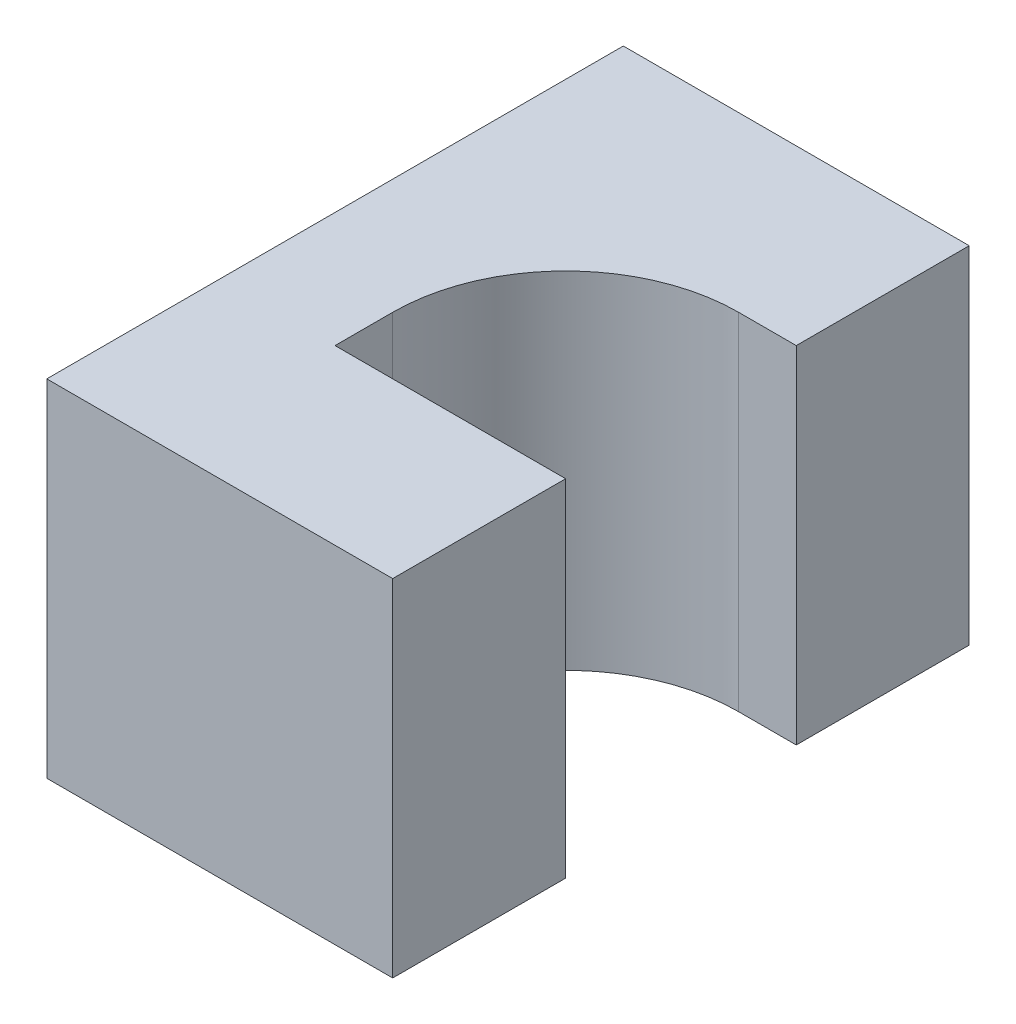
ISO-10303-21;
HEADER;
FILE_DESCRIPTION(('STEP AP214'),'2;1');
FILE_NAME('part.step','',(''),(''),'','','');
FILE_SCHEMA(('AUTOMOTIVE_DESIGN { 1 0 10303 214 1 1 1 1 }'));
ENDSEC;
DATA;
#1=APPLICATION_CONTEXT('core data for automotive mechanical design processes');
#2=APPLICATION_PROTOCOL_DEFINITION('international standard','automotive_design',2000,#1);
#3=PRODUCT_CONTEXT('',#1,'mechanical');
#4=PRODUCT('Part','Part','',(#3));
#5=PRODUCT_RELATED_PRODUCT_CATEGORY('part','',(#4));
#6=PRODUCT_DEFINITION_FORMATION('','',#4);
#7=PRODUCT_DEFINITION_CONTEXT('part definition',#1,'design');
#8=PRODUCT_DEFINITION('design','',#6,#7);
#9=PRODUCT_DEFINITION_SHAPE('','',#8);
#10=(LENGTH_UNIT() NAMED_UNIT(*) SI_UNIT(.MILLI.,.METRE.));
#11=(NAMED_UNIT(*) PLANE_ANGLE_UNIT() SI_UNIT($,.RADIAN.));
#12=(NAMED_UNIT(*) SI_UNIT($,.STERADIAN.) SOLID_ANGLE_UNIT());
#13=UNCERTAINTY_MEASURE_WITH_UNIT(LENGTH_MEASURE(1.E-05),#10,'distance_accuracy_value','');
#14=(GEOMETRIC_REPRESENTATION_CONTEXT(3) GLOBAL_UNCERTAINTY_ASSIGNED_CONTEXT((#13)) GLOBAL_UNIT_ASSIGNED_CONTEXT((#10,
#11,#12)) REPRESENTATION_CONTEXT('',''));
#15=CARTESIAN_POINT('',(0.,0.,0.));
#16=DIRECTION('',(0.,0.,1.));
#17=DIRECTION('',(1.,0.,0.));
#18=AXIS2_PLACEMENT_3D('',#15,#16,#17);
#19=CARTESIAN_POINT('',(-5.,30.,-20.));
#20=DIRECTION('',(0.,1.,0.));
#21=DIRECTION('',(0.,0.,1.));
#22=AXIS2_PLACEMENT_3D('',#19,#20,#21);
#23=CYLINDRICAL_SURFACE('',#22,15.);
#24=DIRECTION('',(0.,-1.,0.));
#25=VECTOR('',#24,1.);
#26=CARTESIAN_POINT('',(-5.,30.,-35.));
#27=LINE('',#26,#25);
#28=CARTESIAN_POINT('',(-5.,30.,-35.));
#29=VERTEX_POINT('',#28);
#30=CARTESIAN_POINT('',(-5.,0.,-35.));
#31=VERTEX_POINT('',#30);
#32=EDGE_CURVE('E118',#29,#31,#27,.T.);
#33=ORIENTED_EDGE('',*,*,#32,.F.);
#34=CARTESIAN_POINT('',(-5.,30.,-20.));
#35=DIRECTION('',(0.,-1.,0.));
#36=DIRECTION('',(0.,0.,-1.));
#37=AXIS2_PLACEMENT_3D('',#34,#35,#36);
#38=CIRCLE('',#37,15.);
#39=CARTESIAN_POINT('',(-20.,30.,-20.));
#40=VERTEX_POINT('',#39);
#41=EDGE_CURVE('E40',#29,#40,#38,.F.);
#42=ORIENTED_EDGE('',*,*,#41,.T.);
#43=DIRECTION('',(0.,-1.,0.));
#44=VECTOR('',#43,1.);
#45=CARTESIAN_POINT('',(-20.,30.,-20.));
#46=LINE('',#45,#44);
#47=CARTESIAN_POINT('',(-20.,0.,-20.));
#48=VERTEX_POINT('',#47);
#49=EDGE_CURVE('E170',#48,#40,#46,.F.);
#50=ORIENTED_EDGE('',*,*,#49,.F.);
#51=CARTESIAN_POINT('',(-5.,0.,-20.));
#52=DIRECTION('',(0.,-1.,0.));
#53=DIRECTION('',(0.,0.,-1.));
#54=AXIS2_PLACEMENT_3D('',#51,#52,#53);
#55=CIRCLE('',#54,15.);
#56=EDGE_CURVE('E11',#48,#31,#55,.T.);
#57=ORIENTED_EDGE('',*,*,#56,.T.);
#58=EDGE_LOOP('',(#33,#42,#50,#57));
#59=FACE_BOUND('',#58,.T.);
#60=ADVANCED_FACE('F33',(#59),#23,.F.);
#61=CARTESIAN_POINT('',(0.,30.,-15.));
#62=DIRECTION('',(-1.,0.,0.));
#63=DIRECTION('',(0.,0.,1.));
#64=AXIS2_PLACEMENT_3D('',#61,#62,#63);
#65=PLANE('',#64);
#66=DIRECTION('',(0.,0.,-1.));
#67=VECTOR('',#66,1.);
#68=CARTESIAN_POINT('',(0.,0.,-15.));
#69=LINE('',#68,#67);
#70=CARTESIAN_POINT('',(0.,0.,0.));
#71=VERTEX_POINT('',#70);
#72=CARTESIAN_POINT('',(0.,0.,-15.));
#73=VERTEX_POINT('',#72);
#74=EDGE_CURVE('E104',#71,#73,#69,.T.);
#75=ORIENTED_EDGE('',*,*,#74,.T.);
#76=DIRECTION('',(0.,-1.,0.));
#77=VECTOR('',#76,1.);
#78=CARTESIAN_POINT('',(0.,30.,-15.));
#79=LINE('',#78,#77);
#80=CARTESIAN_POINT('',(0.,30.,-15.));
#81=VERTEX_POINT('',#80);
#82=EDGE_CURVE('E112',#81,#73,#79,.T.);
#83=ORIENTED_EDGE('',*,*,#82,.F.);
#84=DIRECTION('',(0.,0.,-1.));
#85=VECTOR('',#84,1.);
#86=CARTESIAN_POINT('',(0.,30.,-15.));
#87=LINE('',#86,#85);
#88=CARTESIAN_POINT('',(0.,30.,0.));
#89=VERTEX_POINT('',#88);
#90=EDGE_CURVE('E138',#89,#81,#87,.T.);
#91=ORIENTED_EDGE('',*,*,#90,.F.);
#92=DIRECTION('',(0.,-1.,0.));
#93=VECTOR('',#92,1.);
#94=CARTESIAN_POINT('',(0.,30.,0.));
#95=LINE('',#94,#93);
#96=EDGE_CURVE('E124',#89,#71,#95,.T.);
#97=ORIENTED_EDGE('',*,*,#96,.T.);
#98=EDGE_LOOP('',(#75,#83,#91,#97));
#99=FACE_BOUND('',#98,.T.);
#100=ADVANCED_FACE('F122',(#99),#65,.F.);
#101=CARTESIAN_POINT('',(-20.,30.,-15.));
#102=DIRECTION('',(0.,0.,1.));
#103=DIRECTION('',(1.,0.,0.));
#104=AXIS2_PLACEMENT_3D('',#101,#102,#103);
#105=PLANE('',#104);
#106=DIRECTION('',(-1.,0.,0.));
#107=VECTOR('',#106,1.);
#108=CARTESIAN_POINT('',(-20.,0.,-15.));
#109=LINE('',#108,#107);
#110=CARTESIAN_POINT('',(-20.,0.,-15.));
#111=VERTEX_POINT('',#110);
#112=EDGE_CURVE('E99',#73,#111,#109,.T.);
#113=ORIENTED_EDGE('',*,*,#112,.T.);
#114=DIRECTION('',(0.,-1.,0.));
#115=VECTOR('',#114,1.);
#116=CARTESIAN_POINT('',(-20.,30.,-15.));
#117=LINE('',#116,#115);
#118=CARTESIAN_POINT('',(-20.,30.,-15.));
#119=VERTEX_POINT('',#118);
#120=EDGE_CURVE('E119',#119,#111,#117,.T.);
#121=ORIENTED_EDGE('',*,*,#120,.F.);
#122=DIRECTION('',(-1.,0.,0.));
#123=VECTOR('',#122,1.);
#124=CARTESIAN_POINT('',(-20.,30.,-15.));
#125=LINE('',#124,#123);
#126=EDGE_CURVE('E114',#81,#119,#125,.T.);
#127=ORIENTED_EDGE('',*,*,#126,.F.);
#128=ORIENTED_EDGE('',*,*,#82,.T.);
#129=EDGE_LOOP('',(#113,#121,#127,#128));
#130=FACE_BOUND('',#129,.T.);
#131=ADVANCED_FACE('F113',(#130),#105,.F.);
#132=CARTESIAN_POINT('',(-20.,30.,-30.));
#133=DIRECTION('',(-1.,0.,0.));
#134=DIRECTION('',(0.,0.,1.));
#135=AXIS2_PLACEMENT_3D('',#132,#133,#134);
#136=PLANE('',#135);
#137=DIRECTION('',(0.,0.,-1.));
#138=VECTOR('',#137,1.);
#139=CARTESIAN_POINT('',(-20.,0.,-30.));
#140=LINE('',#139,#138);
#141=EDGE_CURVE('E106',#111,#48,#140,.T.);
#142=ORIENTED_EDGE('',*,*,#141,.T.);
#143=ORIENTED_EDGE('',*,*,#49,.T.);
#144=DIRECTION('',(0.,0.,-1.));
#145=VECTOR('',#144,1.);
#146=CARTESIAN_POINT('',(-20.,30.,-30.));
#147=LINE('',#146,#145);
#148=EDGE_CURVE('E141',#119,#40,#147,.T.);
#149=ORIENTED_EDGE('',*,*,#148,.F.);
#150=ORIENTED_EDGE('',*,*,#120,.T.);
#151=EDGE_LOOP('',(#142,#143,#149,#150));
#152=FACE_BOUND('',#151,.T.);
#153=ADVANCED_FACE('F173',(#152),#136,.F.);
#154=CARTESIAN_POINT('',(0.,30.,-35.));
#155=DIRECTION('',(0.,0.,-1.));
#156=DIRECTION('',(-1.,0.,0.));
#157=AXIS2_PLACEMENT_3D('',#154,#155,#156);
#158=PLANE('',#157);
#159=DIRECTION('',(1.,0.,0.));
#160=VECTOR('',#159,1.);
#161=CARTESIAN_POINT('',(0.,30.,-35.));
#162=LINE('',#161,#160);
#163=CARTESIAN_POINT('',(0.,30.,-35.));
#164=VERTEX_POINT('',#163);
#165=EDGE_CURVE('E144',#29,#164,#162,.T.);
#166=ORIENTED_EDGE('',*,*,#165,.F.);
#167=ORIENTED_EDGE('',*,*,#32,.T.);
#168=DIRECTION('',(1.,0.,0.));
#169=VECTOR('',#168,1.);
#170=CARTESIAN_POINT('',(0.,0.,-35.));
#171=LINE('',#170,#169);
#172=CARTESIAN_POINT('',(0.,0.,-35.));
#173=VERTEX_POINT('',#172);
#174=EDGE_CURVE('E128',#31,#173,#171,.T.);
#175=ORIENTED_EDGE('',*,*,#174,.T.);
#176=DIRECTION('',(0.,-1.,0.));
#177=VECTOR('',#176,1.);
#178=CARTESIAN_POINT('',(0.,30.,-35.));
#179=LINE('',#178,#177);
#180=EDGE_CURVE('E164',#164,#173,#179,.T.);
#181=ORIENTED_EDGE('',*,*,#180,.F.);
#182=EDGE_LOOP('',(#166,#167,#175,#181));
#183=FACE_BOUND('',#182,.T.);
#184=ADVANCED_FACE('F197',(#183),#158,.F.);
#185=CARTESIAN_POINT('',(0.,30.,-50.));
#186=DIRECTION('',(-1.,0.,0.));
#187=DIRECTION('',(0.,0.,1.));
#188=AXIS2_PLACEMENT_3D('',#185,#186,#187);
#189=PLANE('',#188);
#190=DIRECTION('',(0.,0.,-1.));
#191=VECTOR('',#190,1.);
#192=CARTESIAN_POINT('',(0.,0.,-50.));
#193=LINE('',#192,#191);
#194=CARTESIAN_POINT('',(0.,0.,-50.));
#195=VERTEX_POINT('',#194);
#196=EDGE_CURVE('E130',#173,#195,#193,.T.);
#197=ORIENTED_EDGE('',*,*,#196,.T.);
#198=DIRECTION('',(0.,-1.,0.));
#199=VECTOR('',#198,1.);
#200=CARTESIAN_POINT('',(0.,30.,-50.));
#201=LINE('',#200,#199);
#202=CARTESIAN_POINT('',(0.,30.,-50.));
#203=VERTEX_POINT('',#202);
#204=EDGE_CURVE('E161',#203,#195,#201,.T.);
#205=ORIENTED_EDGE('',*,*,#204,.F.);
#206=DIRECTION('',(0.,0.,-1.));
#207=VECTOR('',#206,1.);
#208=CARTESIAN_POINT('',(0.,30.,-50.));
#209=LINE('',#208,#207);
#210=EDGE_CURVE('E146',#164,#203,#209,.T.);
#211=ORIENTED_EDGE('',*,*,#210,.F.);
#212=ORIENTED_EDGE('',*,*,#180,.T.);
#213=EDGE_LOOP('',(#197,#205,#211,#212));
#214=FACE_BOUND('',#213,.T.);
#215=ADVANCED_FACE('F193',(#214),#189,.F.);
#216=CARTESIAN_POINT('',(-30.,30.,-50.));
#217=DIRECTION('',(0.,0.,1.));
#218=DIRECTION('',(1.,0.,0.));
#219=AXIS2_PLACEMENT_3D('',#216,#217,#218);
#220=PLANE('',#219);
#221=DIRECTION('',(-1.,0.,0.));
#222=VECTOR('',#221,1.);
#223=CARTESIAN_POINT('',(-30.,0.,-50.));
#224=LINE('',#223,#222);
#225=CARTESIAN_POINT('',(-30.,0.,-50.));
#226=VERTEX_POINT('',#225);
#227=EDGE_CURVE('E132',#195,#226,#224,.T.);
#228=ORIENTED_EDGE('',*,*,#227,.T.);
#229=DIRECTION('',(0.,-1.,0.));
#230=VECTOR('',#229,1.);
#231=CARTESIAN_POINT('',(-30.,30.,-50.));
#232=LINE('',#231,#230);
#233=CARTESIAN_POINT('',(-30.,30.,-50.));
#234=VERTEX_POINT('',#233);
#235=EDGE_CURVE('E158',#234,#226,#232,.T.);
#236=ORIENTED_EDGE('',*,*,#235,.F.);
#237=DIRECTION('',(-1.,0.,0.));
#238=VECTOR('',#237,1.);
#239=CARTESIAN_POINT('',(-30.,30.,-50.));
#240=LINE('',#239,#238);
#241=EDGE_CURVE('E148',#203,#234,#240,.T.);
#242=ORIENTED_EDGE('',*,*,#241,.F.);
#243=ORIENTED_EDGE('',*,*,#204,.T.);
#244=EDGE_LOOP('',(#228,#236,#242,#243));
#245=FACE_BOUND('',#244,.T.);
#246=ADVANCED_FACE('F189',(#245),#220,.F.);
#247=CARTESIAN_POINT('',(-30.,30.,0.));
#248=DIRECTION('',(1.,0.,0.));
#249=DIRECTION('',(0.,0.,-1.));
#250=AXIS2_PLACEMENT_3D('',#247,#248,#249);
#251=PLANE('',#250);
#252=DIRECTION('',(0.,0.,1.));
#253=VECTOR('',#252,1.);
#254=CARTESIAN_POINT('',(-30.,0.,0.));
#255=LINE('',#254,#253);
#256=CARTESIAN_POINT('',(-30.,0.,0.));
#257=VERTEX_POINT('',#256);
#258=EDGE_CURVE('E134',#226,#257,#255,.T.);
#259=ORIENTED_EDGE('',*,*,#258,.T.);
#260=DIRECTION('',(0.,-1.,0.));
#261=VECTOR('',#260,1.);
#262=CARTESIAN_POINT('',(-30.,30.,0.));
#263=LINE('',#262,#261);
#264=CARTESIAN_POINT('',(-30.,30.,0.));
#265=VERTEX_POINT('',#264);
#266=EDGE_CURVE('E155',#265,#257,#263,.T.);
#267=ORIENTED_EDGE('',*,*,#266,.F.);
#268=DIRECTION('',(0.,0.,1.));
#269=VECTOR('',#268,1.);
#270=CARTESIAN_POINT('',(-30.,30.,0.));
#271=LINE('',#270,#269);
#272=EDGE_CURVE('E150',#234,#265,#271,.T.);
#273=ORIENTED_EDGE('',*,*,#272,.F.);
#274=ORIENTED_EDGE('',*,*,#235,.T.);
#275=EDGE_LOOP('',(#259,#267,#273,#274));
#276=FACE_BOUND('',#275,.T.);
#277=ADVANCED_FACE('F185',(#276),#251,.F.);
#278=CARTESIAN_POINT('',(0.,30.,0.));
#279=DIRECTION('',(0.,0.,-1.));
#280=DIRECTION('',(-1.,0.,0.));
#281=AXIS2_PLACEMENT_3D('',#278,#279,#280);
#282=PLANE('',#281);
#283=DIRECTION('',(1.,0.,0.));
#284=VECTOR('',#283,1.);
#285=CARTESIAN_POINT('',(0.,0.,0.));
#286=LINE('',#285,#284);
#287=EDGE_CURVE('E136',#257,#71,#286,.T.);
#288=ORIENTED_EDGE('',*,*,#287,.T.);
#289=ORIENTED_EDGE('',*,*,#96,.F.);
#290=DIRECTION('',(1.,0.,0.));
#291=VECTOR('',#290,1.);
#292=CARTESIAN_POINT('',(0.,30.,0.));
#293=LINE('',#292,#291);
#294=EDGE_CURVE('E152',#265,#89,#293,.T.);
#295=ORIENTED_EDGE('',*,*,#294,.F.);
#296=ORIENTED_EDGE('',*,*,#266,.T.);
#297=EDGE_LOOP('',(#288,#289,#295,#296));
#298=FACE_BOUND('',#297,.T.);
#299=ADVANCED_FACE('F180',(#298),#282,.F.);
#300=CARTESIAN_POINT('',(0.,30.,0.));
#301=DIRECTION('',(0.,-1.,0.));
#302=DIRECTION('',(0.,0.,-1.));
#303=AXIS2_PLACEMENT_3D('',#300,#301,#302);
#304=PLANE('',#303);
#305=ORIENTED_EDGE('',*,*,#41,.F.);
#306=ORIENTED_EDGE('',*,*,#165,.T.);
#307=ORIENTED_EDGE('',*,*,#210,.T.);
#308=ORIENTED_EDGE('',*,*,#241,.T.);
#309=ORIENTED_EDGE('',*,*,#272,.T.);
#310=ORIENTED_EDGE('',*,*,#294,.T.);
#311=ORIENTED_EDGE('',*,*,#90,.T.);
#312=ORIENTED_EDGE('',*,*,#126,.T.);
#313=ORIENTED_EDGE('',*,*,#148,.T.);
#314=EDGE_LOOP('',(#305,#306,#307,#308,#309,#310,#311,#312,#313));
#315=FACE_BOUND('',#314,.T.);
#316=ADVANCED_FACE('F175',(#315),#304,.F.);
#317=CARTESIAN_POINT('',(0.,0.,0.));
#318=DIRECTION('',(0.,-1.,0.));
#319=DIRECTION('',(0.,0.,-1.));
#320=AXIS2_PLACEMENT_3D('',#317,#318,#319);
#321=PLANE('',#320);
#322=ORIENTED_EDGE('',*,*,#74,.F.);
#323=ORIENTED_EDGE('',*,*,#287,.F.);
#324=ORIENTED_EDGE('',*,*,#258,.F.);
#325=ORIENTED_EDGE('',*,*,#227,.F.);
#326=ORIENTED_EDGE('',*,*,#196,.F.);
#327=ORIENTED_EDGE('',*,*,#174,.F.);
#328=ORIENTED_EDGE('',*,*,#56,.F.);
#329=ORIENTED_EDGE('',*,*,#141,.F.);
#330=ORIENTED_EDGE('',*,*,#112,.F.);
#331=EDGE_LOOP('',(#322,#323,#324,#325,#326,#327,#328,#329,#330));
#332=FACE_BOUND('',#331,.T.);
#333=ADVANCED_FACE('F101',(#332),#321,.T.);
#334=CLOSED_SHELL('',(#60,#100,#131,#153,#184,#215,#246,#277,#299,#316,#333));
#335=MANIFOLD_SOLID_BREP('B2',#334);
#336=ADVANCED_BREP_SHAPE_REPRESENTATION('',(#18,#335),#14);
#337=SHAPE_DEFINITION_REPRESENTATION(#9,#336);
ENDSEC;
END-ISO-10303-21;
